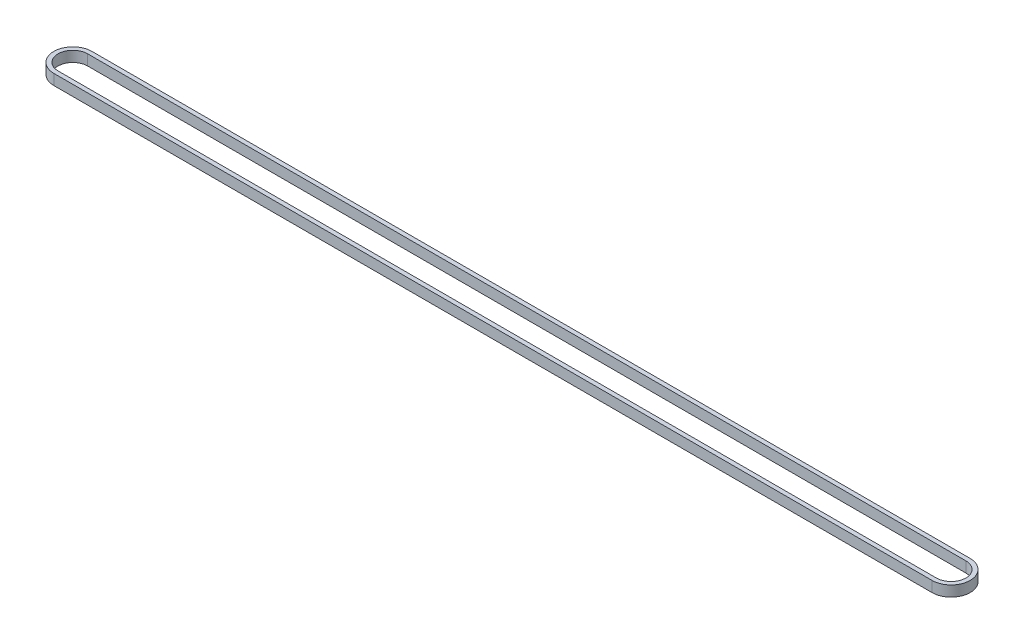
ISO-10303-21;
HEADER;
FILE_DESCRIPTION(('STEP AP214'),'2;1');
FILE_NAME('part.step','',(''),(''),'','','');
FILE_SCHEMA(('AUTOMOTIVE_DESIGN { 1 0 10303 214 1 1 1 1 }'));
ENDSEC;
DATA;
#1=APPLICATION_CONTEXT('core data for automotive mechanical design processes');
#2=APPLICATION_PROTOCOL_DEFINITION('international standard','automotive_design',2000,#1);
#3=PRODUCT_CONTEXT('',#1,'mechanical');
#4=PRODUCT('Part','Part','',(#3));
#5=PRODUCT_RELATED_PRODUCT_CATEGORY('part','',(#4));
#6=PRODUCT_DEFINITION_FORMATION('','',#4);
#7=PRODUCT_DEFINITION_CONTEXT('part definition',#1,'design');
#8=PRODUCT_DEFINITION('design','',#6,#7);
#9=PRODUCT_DEFINITION_SHAPE('','',#8);
#10=(LENGTH_UNIT() NAMED_UNIT(*) SI_UNIT(.MILLI.,.METRE.));
#11=(NAMED_UNIT(*) PLANE_ANGLE_UNIT() SI_UNIT($,.RADIAN.));
#12=(NAMED_UNIT(*) SI_UNIT($,.STERADIAN.) SOLID_ANGLE_UNIT());
#13=UNCERTAINTY_MEASURE_WITH_UNIT(LENGTH_MEASURE(1.E-05),#10,'distance_accuracy_value','');
#14=(GEOMETRIC_REPRESENTATION_CONTEXT(3) GLOBAL_UNCERTAINTY_ASSIGNED_CONTEXT((#13)) GLOBAL_UNIT_ASSIGNED_CONTEXT((#10,
#11,#12)) REPRESENTATION_CONTEXT('',''));
#15=CARTESIAN_POINT('',(0.,0.,0.));
#16=DIRECTION('',(0.,0.,1.));
#17=DIRECTION('',(1.,0.,0.));
#18=AXIS2_PLACEMENT_3D('',#15,#16,#17);
#19=CARTESIAN_POINT('',(0.,5.,-9.));
#20=DIRECTION('',(0.,0.,1.));
#21=DIRECTION('',(1.,0.,0.));
#22=AXIS2_PLACEMENT_3D('',#19,#20,#21);
#23=PLANE('',#22);
#24=DIRECTION('',(0.,-1.,0.));
#25=VECTOR('',#24,1.);
#26=CARTESIAN_POINT('',(0.,5.,-9.));
#27=LINE('',#26,#25);
#28=CARTESIAN_POINT('',(0.,5.,-9.));
#29=VERTEX_POINT('',#28);
#30=CARTESIAN_POINT('',(0.,0.,-9.));
#31=VERTEX_POINT('',#30);
#32=EDGE_CURVE('E66',#29,#31,#27,.T.);
#33=ORIENTED_EDGE('',*,*,#32,.F.);
#34=DIRECTION('',(1.,0.,0.));
#35=VECTOR('',#34,1.);
#36=CARTESIAN_POINT('',(0.,5.,-9.));
#37=LINE('',#36,#35);
#38=CARTESIAN_POINT('',(415.,5.,-9.));
#39=VERTEX_POINT('',#38);
#40=EDGE_CURVE('E68',#39,#29,#37,.F.);
#41=ORIENTED_EDGE('',*,*,#40,.F.);
#42=DIRECTION('',(0.,-1.,0.));
#43=VECTOR('',#42,1.);
#44=CARTESIAN_POINT('',(415.,5.,-9.));
#45=LINE('',#44,#43);
#46=CARTESIAN_POINT('',(415.,0.,-9.));
#47=VERTEX_POINT('',#46);
#48=EDGE_CURVE('E116',#47,#39,#45,.F.);
#49=ORIENTED_EDGE('',*,*,#48,.F.);
#50=DIRECTION('',(1.,0.,0.));
#51=VECTOR('',#50,1.);
#52=CARTESIAN_POINT('',(0.,0.,-9.));
#53=LINE('',#52,#51);
#54=EDGE_CURVE('E70',#47,#31,#53,.F.);
#55=ORIENTED_EDGE('',*,*,#54,.T.);
#56=EDGE_LOOP('',(#33,#41,#49,#55));
#57=FACE_BOUND('',#56,.T.);
#58=ADVANCED_FACE('F17',(#57),#23,.F.);
#59=CARTESIAN_POINT('',(0.,5.,-7.));
#60=DIRECTION('',(0.,0.,1.));
#61=DIRECTION('',(1.,0.,0.));
#62=AXIS2_PLACEMENT_3D('',#59,#60,#61);
#63=PLANE('',#62);
#64=DIRECTION('',(1.,0.,0.));
#65=VECTOR('',#64,1.);
#66=CARTESIAN_POINT('',(0.,5.,-7.));
#67=LINE('',#66,#65);
#68=CARTESIAN_POINT('',(0.,5.,-7.));
#69=VERTEX_POINT('',#68);
#70=CARTESIAN_POINT('',(415.,5.,-7.));
#71=VERTEX_POINT('',#70);
#72=EDGE_CURVE('E100',#69,#71,#67,.T.);
#73=ORIENTED_EDGE('',*,*,#72,.F.);
#74=DIRECTION('',(0.,-1.,0.));
#75=VECTOR('',#74,1.);
#76=CARTESIAN_POINT('',(0.,5.,-7.));
#77=LINE('',#76,#75);
#78=CARTESIAN_POINT('',(0.,0.,-7.));
#79=VERTEX_POINT('',#78);
#80=EDGE_CURVE('E75',#69,#79,#77,.T.);
#81=ORIENTED_EDGE('',*,*,#80,.T.);
#82=DIRECTION('',(1.,0.,0.));
#83=VECTOR('',#82,1.);
#84=CARTESIAN_POINT('',(0.,0.,-7.));
#85=LINE('',#84,#83);
#86=CARTESIAN_POINT('',(415.,0.,-7.));
#87=VERTEX_POINT('',#86);
#88=EDGE_CURVE('E121',#79,#87,#85,.T.);
#89=ORIENTED_EDGE('',*,*,#88,.T.);
#90=DIRECTION('',(0.,-1.,0.));
#91=VECTOR('',#90,1.);
#92=CARTESIAN_POINT('',(415.,5.,-7.));
#93=LINE('',#92,#91);
#94=EDGE_CURVE('E113',#87,#71,#93,.F.);
#95=ORIENTED_EDGE('',*,*,#94,.T.);
#96=EDGE_LOOP('',(#73,#81,#89,#95));
#97=FACE_BOUND('',#96,.T.);
#98=ADVANCED_FACE('F134',(#97),#63,.T.);
#99=CARTESIAN_POINT('',(415.,5.,0.));
#100=DIRECTION('',(0.,-1.,0.));
#101=DIRECTION('',(0.,0.,-1.));
#102=AXIS2_PLACEMENT_3D('',#99,#100,#101);
#103=CYLINDRICAL_SURFACE('',#102,7.);
#104=DIRECTION('',(0.,1.,0.));
#105=VECTOR('',#104,1.);
#106=CARTESIAN_POINT('',(415.,5.,7.));
#107=LINE('',#106,#105);
#108=CARTESIAN_POINT('',(415.,5.,7.));
#109=VERTEX_POINT('',#108);
#110=CARTESIAN_POINT('',(415.,0.,7.));
#111=VERTEX_POINT('',#110);
#112=EDGE_CURVE('E110',#109,#111,#107,.F.);
#113=ORIENTED_EDGE('',*,*,#112,.F.);
#114=CARTESIAN_POINT('',(415.,5.,0.));
#115=DIRECTION('',(0.,-1.,0.));
#116=DIRECTION('',(0.,0.,-1.));
#117=AXIS2_PLACEMENT_3D('',#114,#115,#116);
#118=CIRCLE('',#117,7.);
#119=EDGE_CURVE('E102',#71,#109,#118,.T.);
#120=ORIENTED_EDGE('',*,*,#119,.F.);
#121=ORIENTED_EDGE('',*,*,#94,.F.);
#122=CARTESIAN_POINT('',(415.,0.,0.));
#123=DIRECTION('',(0.,-1.,0.));
#124=DIRECTION('',(0.,0.,-1.));
#125=AXIS2_PLACEMENT_3D('',#122,#123,#124);
#126=CIRCLE('',#125,7.);
#127=EDGE_CURVE('E118',#87,#111,#126,.T.);
#128=ORIENTED_EDGE('',*,*,#127,.T.);
#129=EDGE_LOOP('',(#113,#120,#121,#128));
#130=FACE_BOUND('',#129,.T.);
#131=ADVANCED_FACE('F143',(#130),#103,.F.);
#132=CARTESIAN_POINT('',(0.,5.,7.));
#133=DIRECTION('',(0.,0.,-1.));
#134=DIRECTION('',(-1.,0.,0.));
#135=AXIS2_PLACEMENT_3D('',#132,#133,#134);
#136=PLANE('',#135);
#137=DIRECTION('',(1.,0.,0.));
#138=VECTOR('',#137,1.);
#139=CARTESIAN_POINT('',(0.,5.,7.));
#140=LINE('',#139,#138);
#141=CARTESIAN_POINT('',(0.,5.,7.));
#142=VERTEX_POINT('',#141);
#143=EDGE_CURVE('E83',#109,#142,#140,.F.);
#144=ORIENTED_EDGE('',*,*,#143,.F.);
#145=ORIENTED_EDGE('',*,*,#112,.T.);
#146=DIRECTION('',(1.,0.,0.));
#147=VECTOR('',#146,1.);
#148=CARTESIAN_POINT('',(0.,0.,7.));
#149=LINE('',#148,#147);
#150=CARTESIAN_POINT('',(0.,0.,7.));
#151=VERTEX_POINT('',#150);
#152=EDGE_CURVE('E96',#111,#151,#149,.F.);
#153=ORIENTED_EDGE('',*,*,#152,.T.);
#154=DIRECTION('',(0.,-1.,0.));
#155=VECTOR('',#154,1.);
#156=CARTESIAN_POINT('',(0.,5.,7.));
#157=LINE('',#156,#155);
#158=EDGE_CURVE('E107',#151,#142,#157,.F.);
#159=ORIENTED_EDGE('',*,*,#158,.T.);
#160=EDGE_LOOP('',(#144,#145,#153,#159));
#161=FACE_BOUND('',#160,.T.);
#162=ADVANCED_FACE('F145',(#161),#136,.T.);
#163=CARTESIAN_POINT('',(0.,5.,0.));
#164=DIRECTION('',(0.,-1.,0.));
#165=DIRECTION('',(0.,0.,-1.));
#166=AXIS2_PLACEMENT_3D('',#163,#164,#165);
#167=CYLINDRICAL_SURFACE('',#166,7.);
#168=ORIENTED_EDGE('',*,*,#80,.F.);
#169=CARTESIAN_POINT('',(0.,5.,0.));
#170=DIRECTION('',(0.,-1.,0.));
#171=DIRECTION('',(0.,0.,-1.));
#172=AXIS2_PLACEMENT_3D('',#169,#170,#171);
#173=CIRCLE('',#172,7.);
#174=EDGE_CURVE('E103',#142,#69,#173,.T.);
#175=ORIENTED_EDGE('',*,*,#174,.F.);
#176=ORIENTED_EDGE('',*,*,#158,.F.);
#177=CARTESIAN_POINT('',(0.,0.,0.));
#178=DIRECTION('',(0.,-1.,0.));
#179=DIRECTION('',(0.,0.,-1.));
#180=AXIS2_PLACEMENT_3D('',#177,#178,#179);
#181=CIRCLE('',#180,7.);
#182=EDGE_CURVE('E92',#151,#79,#181,.T.);
#183=ORIENTED_EDGE('',*,*,#182,.T.);
#184=EDGE_LOOP('',(#168,#175,#176,#183));
#185=FACE_BOUND('',#184,.T.);
#186=ADVANCED_FACE('F151',(#185),#167,.F.);
#187=CARTESIAN_POINT('',(0.,5.,0.));
#188=DIRECTION('',(0.,-1.,0.));
#189=DIRECTION('',(0.,0.,-1.));
#190=AXIS2_PLACEMENT_3D('',#187,#188,#189);
#191=CYLINDRICAL_SURFACE('',#190,9.);
#192=CARTESIAN_POINT('',(0.,5.,0.));
#193=DIRECTION('',(0.,-1.,0.));
#194=DIRECTION('',(0.,0.,-1.));
#195=AXIS2_PLACEMENT_3D('',#192,#193,#194);
#196=CIRCLE('',#195,9.);
#197=CARTESIAN_POINT('',(0.,5.,9.));
#198=VERTEX_POINT('',#197);
#199=EDGE_CURVE('E20',#29,#198,#196,.F.);
#200=ORIENTED_EDGE('',*,*,#199,.F.);
#201=ORIENTED_EDGE('',*,*,#32,.T.);
#202=CARTESIAN_POINT('',(0.,0.,0.));
#203=DIRECTION('',(0.,-1.,0.));
#204=DIRECTION('',(0.,0.,-1.));
#205=AXIS2_PLACEMENT_3D('',#202,#203,#204);
#206=CIRCLE('',#205,9.);
#207=CARTESIAN_POINT('',(0.,0.,9.));
#208=VERTEX_POINT('',#207);
#209=EDGE_CURVE('E89',#31,#208,#206,.F.);
#210=ORIENTED_EDGE('',*,*,#209,.T.);
#211=DIRECTION('',(0.,1.,0.));
#212=VECTOR('',#211,1.);
#213=CARTESIAN_POINT('',(0.,5.,9.));
#214=LINE('',#213,#212);
#215=EDGE_CURVE('E88',#208,#198,#214,.T.);
#216=ORIENTED_EDGE('',*,*,#215,.T.);
#217=EDGE_LOOP('',(#200,#201,#210,#216));
#218=FACE_BOUND('',#217,.T.);
#219=ADVANCED_FACE('F86',(#218),#191,.T.);
#220=CARTESIAN_POINT('',(0.,5.,0.));
#221=DIRECTION('',(0.,1.,0.));
#222=DIRECTION('',(0.,0.,1.));
#223=AXIS2_PLACEMENT_3D('',#220,#221,#222);
#224=PLANE('',#223);
#225=ORIENTED_EDGE('',*,*,#72,.T.);
#226=ORIENTED_EDGE('',*,*,#119,.T.);
#227=ORIENTED_EDGE('',*,*,#143,.T.);
#228=ORIENTED_EDGE('',*,*,#174,.T.);
#229=EDGE_LOOP('',(#225,#226,#227,#228));
#230=FACE_BOUND('',#229,.T.);
#231=CARTESIAN_POINT('',(415.,5.,0.));
#232=DIRECTION('',(0.,-1.,0.));
#233=DIRECTION('',(0.,0.,-1.));
#234=AXIS2_PLACEMENT_3D('',#231,#232,#233);
#235=CIRCLE('',#234,9.);
#236=CARTESIAN_POINT('',(415.,5.,9.));
#237=VERTEX_POINT('',#236);
#238=EDGE_CURVE('E82',#39,#237,#235,.T.);
#239=ORIENTED_EDGE('',*,*,#238,.F.);
#240=ORIENTED_EDGE('',*,*,#40,.T.);
#241=ORIENTED_EDGE('',*,*,#199,.T.);
#242=DIRECTION('',(-1.,0.,0.));
#243=VECTOR('',#242,1.);
#244=CARTESIAN_POINT('',(0.,5.,9.));
#245=LINE('',#244,#243);
#246=EDGE_CURVE('E91',#198,#237,#245,.F.);
#247=ORIENTED_EDGE('',*,*,#246,.T.);
#248=EDGE_LOOP('',(#239,#240,#241,#247));
#249=FACE_BOUND('',#248,.T.);
#250=ADVANCED_FACE('F79',(#230,#249),#224,.T.);
#251=CARTESIAN_POINT('',(415.,5.,0.));
#252=DIRECTION('',(0.,-1.,0.));
#253=DIRECTION('',(0.,0.,-1.));
#254=AXIS2_PLACEMENT_3D('',#251,#252,#253);
#255=CYLINDRICAL_SURFACE('',#254,9.);
#256=ORIENTED_EDGE('',*,*,#238,.T.);
#257=DIRECTION('',(0.,1.,0.));
#258=VECTOR('',#257,1.);
#259=CARTESIAN_POINT('',(415.,5.,9.));
#260=LINE('',#259,#258);
#261=CARTESIAN_POINT('',(415.,0.,9.));
#262=VERTEX_POINT('',#261);
#263=EDGE_CURVE('E26',#237,#262,#260,.F.);
#264=ORIENTED_EDGE('',*,*,#263,.T.);
#265=CARTESIAN_POINT('',(415.,0.,0.));
#266=DIRECTION('',(0.,-1.,0.));
#267=DIRECTION('',(0.,0.,-1.));
#268=AXIS2_PLACEMENT_3D('',#265,#266,#267);
#269=CIRCLE('',#268,9.);
#270=EDGE_CURVE('E34',#262,#47,#269,.F.);
#271=ORIENTED_EDGE('',*,*,#270,.T.);
#272=ORIENTED_EDGE('',*,*,#48,.T.);
#273=EDGE_LOOP('',(#256,#264,#271,#272));
#274=FACE_BOUND('',#273,.T.);
#275=ADVANCED_FACE('F162',(#274),#255,.T.);
#276=CARTESIAN_POINT('',(0.,0.,0.));
#277=DIRECTION('',(0.,1.,0.));
#278=DIRECTION('',(0.,0.,1.));
#279=AXIS2_PLACEMENT_3D('',#276,#277,#278);
#280=PLANE('',#279);
#281=ORIENTED_EDGE('',*,*,#152,.F.);
#282=ORIENTED_EDGE('',*,*,#127,.F.);
#283=ORIENTED_EDGE('',*,*,#88,.F.);
#284=ORIENTED_EDGE('',*,*,#182,.F.);
#285=EDGE_LOOP('',(#281,#282,#283,#284));
#286=FACE_BOUND('',#285,.T.);
#287=ORIENTED_EDGE('',*,*,#54,.F.);
#288=ORIENTED_EDGE('',*,*,#270,.F.);
#289=DIRECTION('',(-1.,0.,0.));
#290=VECTOR('',#289,1.);
#291=CARTESIAN_POINT('',(0.,0.,9.));
#292=LINE('',#291,#290);
#293=EDGE_CURVE('E11',#262,#208,#292,.T.);
#294=ORIENTED_EDGE('',*,*,#293,.T.);
#295=ORIENTED_EDGE('',*,*,#209,.F.);
#296=EDGE_LOOP('',(#287,#288,#294,#295));
#297=FACE_BOUND('',#296,.T.);
#298=ADVANCED_FACE('F154',(#286,#297),#280,.F.);
#299=CARTESIAN_POINT('',(0.,5.,9.));
#300=DIRECTION('',(0.,0.,-1.));
#301=DIRECTION('',(-1.,0.,0.));
#302=AXIS2_PLACEMENT_3D('',#299,#300,#301);
#303=PLANE('',#302);
#304=ORIENTED_EDGE('',*,*,#263,.F.);
#305=ORIENTED_EDGE('',*,*,#246,.F.);
#306=ORIENTED_EDGE('',*,*,#215,.F.);
#307=ORIENTED_EDGE('',*,*,#293,.F.);
#308=EDGE_LOOP('',(#304,#305,#306,#307));
#309=FACE_BOUND('',#308,.T.);
#310=ADVANCED_FACE('F163',(#309),#303,.F.);
#311=CLOSED_SHELL('',(#58,#98,#131,#162,#186,#219,#250,#275,#298,#310));
#312=MANIFOLD_SOLID_BREP('B1',#311);
#313=ADVANCED_BREP_SHAPE_REPRESENTATION('',(#18,#312),#14);
#314=SHAPE_DEFINITION_REPRESENTATION(#9,#313);
ENDSEC;
END-ISO-10303-21;
